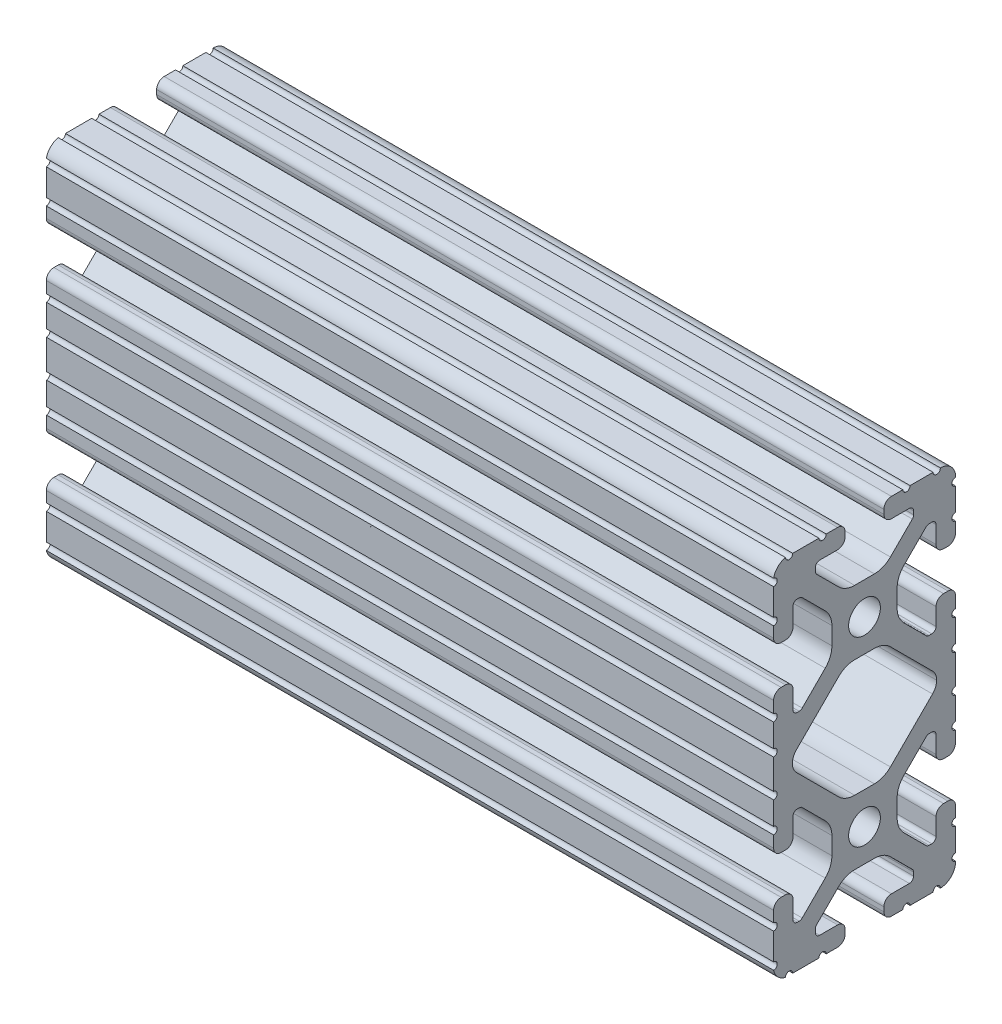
from build123d import *

# Parameters (mm, degrees)
SKETCH1_R      = 3.3274
EXTRUDE1_DEPTH = 152.4


with BuildPart() as part:
    # Sketch1 → Extrude1 (new body)
    with BuildSketch(Plane(origin=(0, 0, 0), x_dir=(0, -1, 0), z_dir=(1, 0, 0))):
        with BuildLine():
            Line((37.1900335, 54.320138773), (37.1900335, 54.882716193))
            ThreePointArc((37.1900335, 54.882716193), (37.450415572, 55.511334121), (38.0790335, 55.771716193))
            Line((38.0790335, 55.771716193), (41.685477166, 55.771716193))
            ThreePointArc((41.685477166, 55.771716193), (42.799028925, 56.232964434), (43.260277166, 57.346516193))
            Line((43.260277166, 57.346516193), (43.260277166, 58.282488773))
            ThreePointArc((43.260277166, 58.282488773), (42.805347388, 59.380786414), (41.707049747, 59.835716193))
            Line((41.707049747, 59.835716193), (39.271813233, 59.835716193))
            ThreePointArc((39.271813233, 59.835716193), (38.509813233, 59.073716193), (37.747813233, 59.835716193))
            Line((37.747813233, 59.835716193), (32.919398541, 59.835716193))
            ThreePointArc((32.919398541, 59.835716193), (32.157398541, 59.073716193), (31.395398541, 59.835716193))
            Line((31.395398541, 59.835716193), (25.153155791, 59.835716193))
            ThreePointArc((25.153155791, 59.835716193), (24.391155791, 59.073716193), (23.629155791, 59.835716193))
            Line((23.629155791, 59.835716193), (18.800741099, 59.835716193))
            ThreePointArc((18.800741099, 59.835716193), (18.038741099, 59.073716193), (17.276741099, 59.835716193))
            Line((17.276741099, 59.835716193), (14.841504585, 59.835716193))
            ThreePointArc((14.841504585, 59.835716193), (13.743206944, 59.380786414), (13.288277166, 58.282488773))
            Line((13.288277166, 58.282488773), (13.288277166, 57.346516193))
            ThreePointArc((13.288277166, 57.346516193), (13.749525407, 56.232964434), (14.863077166, 55.771716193))
            Line((14.863077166, 55.771716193), (18.469520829, 55.771716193))
            ThreePointArc((18.469520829, 55.771716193), (19.098138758, 55.511334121), (19.358520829, 54.882716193))
            Line((19.358520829, 54.882716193), (19.358520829, 54.320138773))
            ThreePointArc((19.358520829, 54.320138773), (19.290850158, 53.979934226), (19.098140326, 53.691522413))
            Line((19.098140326, 53.691522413), (14.421778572, 49.015137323))
            ThreePointArc((14.421778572, 49.015137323), (12.880829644, 47.985503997), (11.063154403, 47.623944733))
            Line((11.063154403, 47.623944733), (7.38539993, 47.623944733))
            ThreePointArc((7.38539993, 47.623944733), (5.567724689, 47.985503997), (4.026775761, 49.015137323))
            Line((4.026775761, 49.015137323), (-0.649585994, 53.691522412))
            ThreePointArc((-0.649585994, 53.691522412), (-0.842295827, 53.979934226), (-0.909966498, 54.320138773))
            Line((-0.909966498, 54.320138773), (-0.909966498, 54.882716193))
            ThreePointArc((-0.909966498, 54.882716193), (-0.649584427, 55.511334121), (-0.020966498, 55.771716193))
            Line((-0.020966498, 55.771716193), (3.585477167, 55.771716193))
            ThreePointArc((3.585477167, 55.771716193), (4.699028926, 56.232964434), (5.160277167, 57.346516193))
            Line((5.160277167, 57.346516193), (5.160277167, 58.266281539))
            ThreePointArc((5.160277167, 58.266281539), (4.744040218, 59.332924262), (3.715361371, 59.835716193))
            Line((3.715361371, 59.835716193), (1.328459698, 59.835716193))
            ThreePointArc((1.328459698, 59.835716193), (0.566459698, 59.073716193), (-0.195540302, 59.835716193))
            Line((-0.195540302, 59.835716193), (-5.021979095, 59.835716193))
            ThreePointArc((-5.021979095, 59.835716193), (-5.807035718, 59.097492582), (-6.545259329, 59.882549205))
            ThreePointArc((-6.545259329, 59.882549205), (-8.87374186, 58.977730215), (-9.863337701, 56.683993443))
            ThreePointArc((-9.863337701, 56.683993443), (-9.063955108, 55.941735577), (-9.825722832, 55.160922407))
            Line((-9.825722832, 55.160922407), (-9.825722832, 50.335417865))
            ThreePointArc((-9.825722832, 50.335417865), (-9.063722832, 49.573417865), (-9.825722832, 48.811417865))
            Line((-9.825722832, 48.811417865), (-9.825722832, 46.424516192))
            ThreePointArc((-9.825722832, 46.424516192), (-9.364474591, 45.310964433), (-8.250922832, 44.849716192))
            Line((-8.250922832, 44.849716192), (-7.336522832, 44.849716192))
            ThreePointArc((-7.336522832, 44.849716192), (-6.222971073, 45.310964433), (-5.761722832, 46.424516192))
            Line((-5.761722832, 46.424516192), (-5.761722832, 50.183716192))
            ThreePointArc((-5.761722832, 50.183716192), (-5.50134076, 50.81233412), (-4.872722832, 51.072716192))
            Line((-4.872722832, 51.072716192), (-4.146379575, 51.072716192))
            ThreePointArc((-4.146379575, 51.072716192), (-3.806172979, 51.005044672), (-3.517760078, 50.812332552))
            Line((-3.517760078, 50.812332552), (1.076701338, 46.217848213))
            ThreePointArc((1.076701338, 46.217848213), (2.10632244, 44.676905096), (2.467877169, 42.859240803))
            Line((2.467877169, 42.859240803), (2.467877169, 38.712191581))
            ThreePointArc((2.467877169, 38.712191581), (2.10632244, 36.894527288), (1.076701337, 35.353584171))
            Line((1.076701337, 35.353584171), (-3.517760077, 30.759099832))
            ThreePointArc((-3.517760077, 30.759099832), (-3.806172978, 30.566387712), (-4.146379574, 30.498716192))
            Line((-4.146379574, 30.498716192), (-4.872722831, 30.498716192))
            ThreePointArc((-4.872722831, 30.498716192), (-5.501340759, 30.759098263), (-5.761722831, 31.387716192))
            Line((-5.761722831, 31.387716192), (-5.761722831, 35.146916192))
            ThreePointArc((-5.761722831, 35.146916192), (-6.222971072, 36.260467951), (-7.336522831, 36.721716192))
            Line((-7.336522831, 36.721716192), (-8.250922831, 36.721716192))
            ThreePointArc((-8.250922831, 36.721716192), (-9.36447459, 36.260467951), (-9.825722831, 35.146916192))
            Line((-9.825722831, 35.146916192), (-9.825722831, 32.760014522))
            ThreePointArc((-9.825722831, 32.760014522), (-9.063722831, 31.998014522), (-9.825722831, 31.236014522))
            Line((-9.825722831, 31.236014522), (-9.825722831, 25.74969698))
            ThreePointArc((-9.825722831, 25.74969698), (-9.063722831, 24.98769698), (-9.825722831, 24.22569698))
            ThreePointArc((-9.825722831, 24.22569698), (-8.934545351, 22.601713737), (-7.296996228, 21.735716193))
            ThreePointArc((-7.296996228, 21.735716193), (-6.534996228, 22.497716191), (-5.77299623, 21.735716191))
            Line((-5.77299623, 21.735716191), (-0.195540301, 21.735716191))
            ThreePointArc((-0.195540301, 21.735716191), (0.566459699, 22.497716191), (1.328459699, 21.735716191))
            Line((1.328459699, 21.735716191), (3.585477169, 21.735716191))
            ThreePointArc((3.585477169, 21.735716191), (4.699028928, 22.196964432), (5.160277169, 23.310516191))
            Line((5.160277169, 23.310516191), (5.160277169, 24.224916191))
            ThreePointArc((5.160277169, 24.224916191), (4.699028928, 25.33846795), (3.585477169, 25.799716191))
            Line((3.585477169, 25.799716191), (-0.173722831, 25.799716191))
            ThreePointArc((-0.173722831, 25.799716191), (-0.80234076, 26.060098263), (-1.062722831, 26.688716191))
            Line((-1.062722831, 26.688716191), (-1.062722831, 27.098536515))
            ThreePointArc((-1.062722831, 27.098536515), (-0.99505216, 27.438741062), (-0.802342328, 27.727152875))
            Line((-0.802342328, 27.727152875), (4.026775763, 32.556295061))
            ThreePointArc((4.026775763, 32.556295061), (5.567724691, 33.585928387), (7.385399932, 33.947487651))
            Line((7.385399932, 33.947487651), (11.063154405, 33.947487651))
            ThreePointArc((11.063154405, 33.947487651), (12.880829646, 33.585928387), (14.421778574, 32.556295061))
            Line((14.421778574, 32.556295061), (19.250896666, 27.727152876))
            ThreePointArc((19.250896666, 27.727152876), (19.443606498, 27.438741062), (19.511277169, 27.098536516))
            Line((19.511277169, 27.098536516), (19.511277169, 26.688716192))
            ThreePointArc((19.511277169, 26.688716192), (19.250895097, 26.060098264), (18.622277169, 25.799716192))
            Line((18.622277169, 25.799716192), (14.863077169, 25.799716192))
            ThreePointArc((14.863077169, 25.799716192), (13.74952541, 25.338467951), (13.288277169, 24.224916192))
            Line((13.288277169, 24.224916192), (13.288277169, 23.310516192))
            ThreePointArc((13.288277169, 23.310516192), (13.74952541, 22.196964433), (14.863077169, 21.735716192))
            Line((14.863077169, 21.735716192), (17.276741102, 21.735716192))
            ThreePointArc((17.276741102, 21.735716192), (18.038741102, 22.497716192), (18.800741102, 21.735716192))
            Line((18.800741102, 21.735716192), (23.629155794, 21.735716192))
            ThreePointArc((23.629155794, 21.735716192), (24.391155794, 22.497716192), (25.153155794, 21.735716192))
            Line((25.153155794, 21.735716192), (31.395398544, 21.735716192))
            ThreePointArc((31.395398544, 21.735716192), (32.157398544, 22.497716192), (32.919398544, 21.735716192))
            Line((32.919398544, 21.735716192), (37.747813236, 21.735716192))
            ThreePointArc((37.747813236, 21.735716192), (38.509813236, 22.497716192), (39.271813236, 21.735716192))
            Line((39.271813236, 21.735716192), (41.685477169, 21.735716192))
            ThreePointArc((41.685477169, 21.735716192), (42.799028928, 22.196964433), (43.260277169, 23.310516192))
            Line((43.260277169, 23.310516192), (43.260277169, 24.224916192))
            ThreePointArc((43.260277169, 24.224916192), (42.799028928, 25.338467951), (41.685477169, 25.799716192))
            Line((41.685477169, 25.799716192), (37.926277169, 25.799716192))
            ThreePointArc((37.926277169, 25.799716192), (37.29765924, 26.060098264), (37.037277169, 26.688716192))
            Line((37.037277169, 26.688716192), (37.037277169, 27.098536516))
            ThreePointArc((37.037277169, 27.098536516), (37.10494784, 27.438741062), (37.297657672, 27.727152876))
            Line((37.297657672, 27.727152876), (42.126775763, 32.556295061))
            ThreePointArc((42.126775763, 32.556295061), (43.667724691, 33.585928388), (45.485399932, 33.947487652))
            Line((45.485399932, 33.947487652), (49.163154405, 33.947487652))
            ThreePointArc((49.163154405, 33.947487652), (50.980829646, 33.585928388), (52.521778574, 32.556295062))
            Line((52.521778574, 32.556295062), (57.350896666, 27.727152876))
            ThreePointArc((57.350896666, 27.727152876), (57.543606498, 27.438741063), (57.611277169, 27.098536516))
            Line((57.611277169, 27.098536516), (57.611277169, 26.688716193))
            ThreePointArc((57.611277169, 26.688716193), (57.350895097, 26.060098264), (56.722277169, 25.799716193))
            Line((56.722277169, 25.799716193), (52.963077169, 25.799716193))
            ThreePointArc((52.963077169, 25.799716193), (51.84952541, 25.338467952), (51.388277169, 24.224916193))
            Line((51.388277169, 24.224916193), (51.388277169, 23.310516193))
            ThreePointArc((51.388277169, 23.310516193), (51.84952541, 22.196964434), (52.963077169, 21.735716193))
            Line((52.963077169, 21.735716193), (55.220094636, 21.735716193))
            ThreePointArc((55.220094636, 21.735716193), (55.982094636, 22.497716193), (56.744094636, 21.735716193))
            Line((56.744094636, 21.735716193), (62.321550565, 21.735716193))
            ThreePointArc((62.321550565, 21.735716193), (63.083550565, 22.497716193), (63.845550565, 21.735716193))
            ThreePointArc((63.845550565, 21.735716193), (65.481854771, 22.602978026), (66.374277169, 24.225696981))
            ThreePointArc((66.374277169, 24.225696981), (65.612277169, 24.987696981), (66.374277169, 25.749696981))
            Line((66.374277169, 25.749696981), (66.374277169, 31.236014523))
            ThreePointArc((66.374277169, 31.236014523), (65.612277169, 31.998014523), (66.374277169, 32.760014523))
            Line((66.374277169, 32.760014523), (66.374277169, 35.146916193))
            ThreePointArc((66.374277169, 35.146916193), (65.913028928, 36.260467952), (64.799477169, 36.721716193))
            Line((64.799477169, 36.721716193), (63.885077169, 36.721716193))
            ThreePointArc((63.885077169, 36.721716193), (62.77152541, 36.260467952), (62.310277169, 35.146916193))
            Line((62.310277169, 35.146916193), (62.310277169, 31.387716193))
            ThreePointArc((62.310277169, 31.387716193), (62.049895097, 30.759098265), (61.421277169, 30.498716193))
            Line((61.421277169, 30.498716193), (60.694933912, 30.498716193))
            ThreePointArc((60.694933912, 30.498716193), (60.354727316, 30.566387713), (60.066314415, 30.759099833))
            Line((60.066314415, 30.759099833), (55.471853, 35.353584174))
            ThreePointArc((55.471853, 35.353584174), (54.442231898, 36.894527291), (54.08067717, 38.712191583))
            Line((54.08067717, 38.712191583), (54.08067717, 42.859240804))
            ThreePointArc((54.08067717, 42.859240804), (54.442231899, 44.676905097), (55.471853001, 46.217848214))
            Line((55.471853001, 46.217848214), (60.066314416, 50.812332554))
            ThreePointArc((60.066314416, 50.812332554), (60.354727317, 51.005044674), (60.694933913, 51.072716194))
            Line((60.694933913, 51.072716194), (61.42127717, 51.072716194))
            ThreePointArc((61.42127717, 51.072716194), (62.049895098, 50.812334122), (62.31027717, 50.183716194))
            Line((62.31027717, 50.183716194), (62.31027717, 46.424516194))
            ThreePointArc((62.31027717, 46.424516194), (62.771525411, 45.310964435), (63.88507717, 44.849716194))
            Line((63.88507717, 44.849716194), (64.79947717, 44.849716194))
            ThreePointArc((64.79947717, 44.849716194), (65.913028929, 45.310964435), (66.37427717, 46.424516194))
            Line((66.37427717, 46.424516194), (66.37427717, 48.811417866))
            ThreePointArc((66.37427717, 48.811417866), (65.61227717, 49.573417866), (66.37427717, 50.335417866))
            Line((66.37427717, 50.335417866), (66.37427717, 55.160922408))
            ThreePointArc((66.37427717, 55.160922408), (65.612509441, 55.941735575), (66.411892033, 56.683993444))
            ThreePointArc((66.411892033, 56.683993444), (65.422296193, 58.977730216), (63.093813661, 59.882549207))
            ThreePointArc((63.093813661, 59.882549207), (62.355590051, 59.097492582), (61.570533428, 59.835716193))
            Line((61.570533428, 59.835716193), (56.744094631, 59.835716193))
            ThreePointArc((56.744094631, 59.835716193), (55.982094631, 59.073716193), (55.220094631, 59.835716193))
            Line((55.220094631, 59.835716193), (52.833192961, 59.835716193))
            ThreePointArc((52.833192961, 59.835716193), (51.804514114, 59.332924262), (51.388277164, 58.266281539))
            Line((51.388277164, 58.266281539), (51.388277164, 57.346516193))
            ThreePointArc((51.388277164, 57.346516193), (51.849525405, 56.232964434), (52.963077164, 55.771716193))
            Line((52.963077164, 55.771716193), (56.569520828, 55.771716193))
            ThreePointArc((56.569520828, 55.771716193), (57.198138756, 55.511334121), (57.458520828, 54.882716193))
            Line((57.458520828, 54.882716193), (57.458520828, 54.320138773))
            ThreePointArc((57.458520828, 54.320138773), (57.390850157, 53.979934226), (57.198140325, 53.691522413))
            Line((57.198140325, 53.691522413), (52.52177857, 49.015137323))
            ThreePointArc((52.52177857, 49.015137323), (50.980829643, 47.985503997), (49.163154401, 47.623944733))
            Line((49.163154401, 47.623944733), (45.485399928, 47.623944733))
            ThreePointArc((45.485399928, 47.623944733), (43.667724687, 47.985503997), (42.12677576, 49.015137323))
            Line((42.12677576, 49.015137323), (37.450414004, 53.691522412))
            ThreePointArc((37.450414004, 53.691522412), (37.257704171, 53.979934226), (37.1900335, 54.320138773))
        make_face()
        with Locations(Location((47.324277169, 40.785716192, 0), (0, 0, 270))):
            Circle(SKETCH1_R, mode=Mode.SUBTRACT)
        with Locations(Location((9.224277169, 40.785716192, 0), (0, 0, 270))):
            Circle(SKETCH1_R, mode=Mode.SUBTRACT)
        with BuildLine():
            Line((30.35131253, 26.52815133), (39.176701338, 35.353584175))
            ThreePointArc((39.176701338, 35.353584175), (40.206322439, 36.894527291), (40.567877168, 38.712191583))
            Line((40.567877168, 38.712191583), (40.567877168, 42.859240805))
            ThreePointArc((40.567877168, 42.859240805), (40.206322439, 44.676905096), (39.176701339, 46.217848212))
            Line((39.176701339, 46.217848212), (30.35131253, 55.043281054))
            ThreePointArc((30.35131253, 55.043281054), (29.39832277, 55.678689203), (28.274277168, 55.898812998))
            ThreePointArc((28.274277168, 55.898812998), (27.150231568, 55.678689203), (26.197241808, 55.043281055))
            Line((26.197241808, 55.043281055), (17.371853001, 46.217848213))
            ThreePointArc((17.371853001, 46.217848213), (16.342231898, 44.676905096), (15.980677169, 42.859240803))
            Line((15.980677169, 42.859240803), (15.980677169, 38.712191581))
            ThreePointArc((15.980677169, 38.712191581), (16.342231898, 36.894527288), (17.371853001, 35.353584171))
            Line((17.371853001, 35.353584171), (26.197241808, 26.528151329))
            ThreePointArc((26.197241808, 26.528151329), (27.150231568, 25.892743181), (28.274277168, 25.672619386))
            ThreePointArc((28.274277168, 25.672619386), (29.39832277, 25.892743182), (30.35131253, 26.52815133))
        make_face(mode=Mode.SUBTRACT)
    extrude(amount=EXTRUDE1_DEPTH)


solid = part.part
